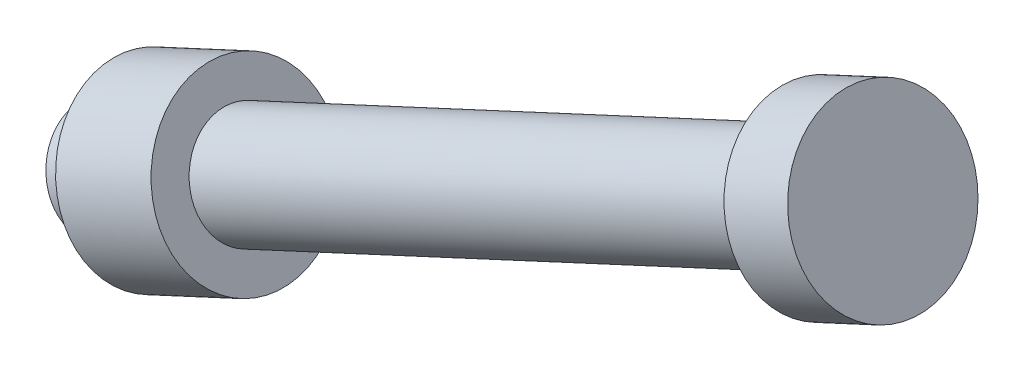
ISO-10303-21;
HEADER;
FILE_DESCRIPTION(('STEP AP214'),'2;1');
FILE_NAME('part.step','',(''),(''),'','','');
FILE_SCHEMA(('AUTOMOTIVE_DESIGN { 1 0 10303 214 1 1 1 1 }'));
ENDSEC;
DATA;
#1=APPLICATION_CONTEXT('core data for automotive mechanical design processes');
#2=APPLICATION_PROTOCOL_DEFINITION('international standard','automotive_design',2000,#1);
#3=PRODUCT_CONTEXT('',#1,'mechanical');
#4=PRODUCT('Part','Part','',(#3));
#5=PRODUCT_RELATED_PRODUCT_CATEGORY('part','',(#4));
#6=PRODUCT_DEFINITION_FORMATION('','',#4);
#7=PRODUCT_DEFINITION_CONTEXT('part definition',#1,'design');
#8=PRODUCT_DEFINITION('design','',#6,#7);
#9=PRODUCT_DEFINITION_SHAPE('','',#8);
#10=(LENGTH_UNIT() NAMED_UNIT(*) SI_UNIT(.MILLI.,.METRE.));
#11=(NAMED_UNIT(*) PLANE_ANGLE_UNIT() SI_UNIT($,.RADIAN.));
#12=(NAMED_UNIT(*) SI_UNIT($,.STERADIAN.) SOLID_ANGLE_UNIT());
#13=UNCERTAINTY_MEASURE_WITH_UNIT(LENGTH_MEASURE(1.E-05),#10,'distance_accuracy_value','');
#14=(GEOMETRIC_REPRESENTATION_CONTEXT(3) GLOBAL_UNCERTAINTY_ASSIGNED_CONTEXT((#13)) GLOBAL_UNIT_ASSIGNED_CONTEXT((#10,
#11,#12)) REPRESENTATION_CONTEXT('',''));
#15=CARTESIAN_POINT('',(0.,0.,0.));
#16=DIRECTION('',(0.,0.,1.));
#17=DIRECTION('',(1.,0.,0.));
#18=AXIS2_PLACEMENT_3D('',#15,#16,#17);
#19=CARTESIAN_POINT('',(436.593406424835,392.886366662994,0.));
#20=DIRECTION('',(0.907075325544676,0.420968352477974,0.));
#21=DIRECTION('',(-0.420968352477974,0.907075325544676,0.));
#22=AXIS2_PLACEMENT_3D('',#19,#20,#21);
#23=PLANE('',#22);
#24=CARTESIAN_POINT('',(436.593406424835,392.886366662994,0.));
#25=DIRECTION('',(0.907075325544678,0.42096835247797,0.));
#26=DIRECTION('',(-0.42096835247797,0.907075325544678,0.));
#27=AXIS2_PLACEMENT_3D('',#24,#25,#26);
#28=CIRCLE('',#27,3.);
#29=CARTESIAN_POINT('',(435.330501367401,395.607592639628,0.));
#30=VERTEX_POINT('',#29);
#31=EDGE_CURVE('E75',#30,#30,#28,.T.);
#32=ORIENTED_EDGE('',*,*,#31,.T.);
#33=EDGE_LOOP('',(#32));
#34=FACE_BOUND('',#33,.T.);
#35=CARTESIAN_POINT('',(436.593406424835,392.886366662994,0.));
#36=DIRECTION('',(0.907075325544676,0.420968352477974,0.));
#37=DIRECTION('',(-0.420968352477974,0.907075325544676,0.));
#38=AXIS2_PLACEMENT_3D('',#35,#36,#37);
#39=CIRCLE('',#38,5.);
#40=CARTESIAN_POINT('',(434.488564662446,397.421743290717,0.));
#41=VERTEX_POINT('',#40);
#42=EDGE_CURVE('E70',#41,#41,#39,.T.);
#43=ORIENTED_EDGE('',*,*,#42,.F.);
#44=EDGE_LOOP('',(#43));
#45=FACE_BOUND('',#44,.T.);
#46=ADVANCED_FACE('F59',(#34,#45),#23,.F.);
#47=CARTESIAN_POINT('',(440.221707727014,394.570240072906,0.));
#48=DIRECTION('',(0.907075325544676,0.420968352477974,0.));
#49=DIRECTION('',(-0.420968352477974,0.907075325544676,0.));
#50=AXIS2_PLACEMENT_3D('',#47,#48,#49);
#51=PLANE('',#50);
#52=CARTESIAN_POINT('',(440.221707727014,394.570240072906,0.));
#53=DIRECTION('',(0.907075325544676,0.420968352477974,0.));
#54=DIRECTION('',(-0.420968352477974,0.907075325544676,0.));
#55=AXIS2_PLACEMENT_3D('',#52,#53,#54);
#56=CIRCLE('',#55,5.);
#57=CARTESIAN_POINT('',(438.116865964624,399.105616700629,0.));
#58=VERTEX_POINT('',#57);
#59=EDGE_CURVE('E66',#58,#58,#56,.T.);
#60=ORIENTED_EDGE('',*,*,#59,.T.);
#61=EDGE_LOOP('',(#60));
#62=FACE_BOUND('',#61,.T.);
#63=ADVANCED_FACE('F111',(#62),#51,.T.);
#64=CARTESIAN_POINT('',(436.593406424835,392.886366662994,0.));
#65=DIRECTION('',(0.907075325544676,0.420968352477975,0.));
#66=DIRECTION('',(-0.420968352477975,0.907075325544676,0.));
#67=AXIS2_PLACEMENT_3D('',#64,#65,#66);
#68=CYLINDRICAL_SURFACE('',#67,5.);
#69=ORIENTED_EDGE('',*,*,#59,.F.);
#70=EDGE_LOOP('',(#69));
#71=FACE_BOUND('',#70,.T.);
#72=ORIENTED_EDGE('',*,*,#42,.T.);
#73=EDGE_LOOP('',(#72));
#74=FACE_BOUND('',#73,.T.);
#75=ADVANCED_FACE('F102',(#71,#74),#68,.T.);
#76=CARTESIAN_POINT('',(395.775016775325,373.942790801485,0.));
#77=DIRECTION('',(0.90707532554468,0.420968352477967,0.));
#78=DIRECTION('',(-0.420968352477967,0.90707532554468,0.));
#79=AXIS2_PLACEMENT_3D('',#76,#77,#78);
#80=CYLINDRICAL_SURFACE('',#79,3.);
#81=CARTESIAN_POINT('',(403.938694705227,377.731505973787,0.));
#82=DIRECTION('',(0.907075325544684,0.420968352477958,0.));
#83=DIRECTION('',(-0.420968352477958,0.907075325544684,0.));
#84=AXIS2_PLACEMENT_3D('',#81,#82,#83);
#85=CIRCLE('',#84,3.);
#86=CARTESIAN_POINT('',(402.675789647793,380.452731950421,0.));
#87=VERTEX_POINT('',#86);
#88=EDGE_CURVE('E11',#87,#87,#85,.F.);
#89=ORIENTED_EDGE('',*,*,#88,.F.);
#90=EDGE_LOOP('',(#89));
#91=FACE_BOUND('',#90,.T.);
#92=ORIENTED_EDGE('',*,*,#31,.F.);
#93=EDGE_LOOP('',(#92));
#94=FACE_BOUND('',#93,.T.);
#95=ADVANCED_FACE('F93',(#91,#94),#80,.T.);
#96=CARTESIAN_POINT('',(398.496242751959,375.205695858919,0.));
#97=DIRECTION('',(0.907075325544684,0.420968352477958,0.));
#98=DIRECTION('',(-0.420968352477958,0.907075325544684,0.));
#99=AXIS2_PLACEMENT_3D('',#96,#97,#98);
#100=PLANE('',#99);
#101=CARTESIAN_POINT('',(398.496242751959,375.205695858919,0.));
#102=DIRECTION('',(0.907075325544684,0.420968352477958,0.));
#103=DIRECTION('',(-0.420968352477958,0.907075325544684,0.));
#104=AXIS2_PLACEMENT_3D('',#101,#102,#103);
#105=CIRCLE('',#104,3.);
#106=CARTESIAN_POINT('',(397.233337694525,377.926921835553,0.));
#107=VERTEX_POINT('',#106);
#108=EDGE_CURVE('E62',#107,#107,#105,.F.);
#109=ORIENTED_EDGE('',*,*,#108,.F.);
#110=EDGE_LOOP('',(#109));
#111=FACE_BOUND('',#110,.T.);
#112=CARTESIAN_POINT('',(398.496242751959,375.205695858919,0.));
#113=DIRECTION('',(0.907075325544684,0.420968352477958,0.));
#114=DIRECTION('',(-0.420968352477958,0.907075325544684,0.));
#115=AXIS2_PLACEMENT_3D('',#112,#113,#114);
#116=CIRCLE('',#115,5.);
#117=CARTESIAN_POINT('',(396.391400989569,379.741072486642,0.));
#118=VERTEX_POINT('',#117);
#119=EDGE_CURVE('E84',#118,#118,#116,.T.);
#120=ORIENTED_EDGE('',*,*,#119,.F.);
#121=EDGE_LOOP('',(#120));
#122=FACE_BOUND('',#121,.T.);
#123=ADVANCED_FACE('F90',(#111,#122),#100,.F.);
#124=CARTESIAN_POINT('',(403.938694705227,377.731505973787,0.));
#125=DIRECTION('',(0.907075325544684,0.420968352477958,0.));
#126=DIRECTION('',(-0.420968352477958,0.907075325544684,0.));
#127=AXIS2_PLACEMENT_3D('',#124,#125,#126);
#128=PLANE('',#127);
#129=ORIENTED_EDGE('',*,*,#88,.T.);
#130=EDGE_LOOP('',(#129));
#131=FACE_BOUND('',#130,.T.);
#132=CARTESIAN_POINT('',(403.938694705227,377.731505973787,0.));
#133=DIRECTION('',(0.907075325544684,0.420968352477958,0.));
#134=DIRECTION('',(-0.420968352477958,0.907075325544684,0.));
#135=AXIS2_PLACEMENT_3D('',#132,#133,#134);
#136=CIRCLE('',#135,5.);
#137=CARTESIAN_POINT('',(401.833852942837,382.26688260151,0.));
#138=VERTEX_POINT('',#137);
#139=EDGE_CURVE('E81',#138,#138,#136,.T.);
#140=ORIENTED_EDGE('',*,*,#139,.T.);
#141=EDGE_LOOP('',(#140));
#142=FACE_BOUND('',#141,.T.);
#143=ADVANCED_FACE('F92',(#131,#142),#128,.T.);
#144=CARTESIAN_POINT('',(398.496242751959,375.205695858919,0.));
#145=DIRECTION('',(0.90707532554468,0.420968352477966,0.));
#146=DIRECTION('',(-0.420968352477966,0.90707532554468,0.));
#147=AXIS2_PLACEMENT_3D('',#144,#145,#146);
#148=CYLINDRICAL_SURFACE('',#147,5.);
#149=ORIENTED_EDGE('',*,*,#139,.F.);
#150=EDGE_LOOP('',(#149));
#151=FACE_BOUND('',#150,.T.);
#152=ORIENTED_EDGE('',*,*,#119,.T.);
#153=EDGE_LOOP('',(#152));
#154=FACE_BOUND('',#153,.T.);
#155=ADVANCED_FACE('F88',(#151,#154),#148,.T.);
#156=CARTESIAN_POINT('',(395.775016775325,373.942790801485,0.));
#157=DIRECTION('',(0.907075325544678,0.42096835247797,0.));
#158=DIRECTION('',(-0.42096835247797,0.907075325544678,0.));
#159=AXIS2_PLACEMENT_3D('',#156,#157,#158);
#160=PLANE('',#159);
#161=CARTESIAN_POINT('',(395.775016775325,373.942790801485,0.));
#162=DIRECTION('',(0.907075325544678,0.42096835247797,0.));
#163=DIRECTION('',(-0.42096835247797,0.907075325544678,0.));
#164=AXIS2_PLACEMENT_3D('',#161,#162,#163);
#165=CIRCLE('',#164,3.);
#166=CARTESIAN_POINT('',(394.512111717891,376.664016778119,0.));
#167=VERTEX_POINT('',#166);
#168=EDGE_CURVE('E78',#167,#167,#165,.T.);
#169=ORIENTED_EDGE('',*,*,#168,.F.);
#170=EDGE_LOOP('',(#169));
#171=FACE_BOUND('',#170,.T.);
#172=ADVANCED_FACE('F96',(#171),#160,.F.);
#173=ORIENTED_EDGE('',*,*,#168,.T.);
#174=EDGE_LOOP('',(#173));
#175=FACE_BOUND('',#174,.T.);
#176=ORIENTED_EDGE('',*,*,#108,.T.);
#177=EDGE_LOOP('',(#176));
#178=FACE_BOUND('',#177,.T.);
#179=ADVANCED_FACE('F105',(#175,#178),#80,.T.);
#180=CLOSED_SHELL('',(#46,#63,#75,#95,#123,#143,#155,#172,#179));
#181=MANIFOLD_SOLID_BREP('B2',#180);
#182=ADVANCED_BREP_SHAPE_REPRESENTATION('',(#18,#181),#14);
#183=SHAPE_DEFINITION_REPRESENTATION(#9,#182);
ENDSEC;
END-ISO-10303-21;
